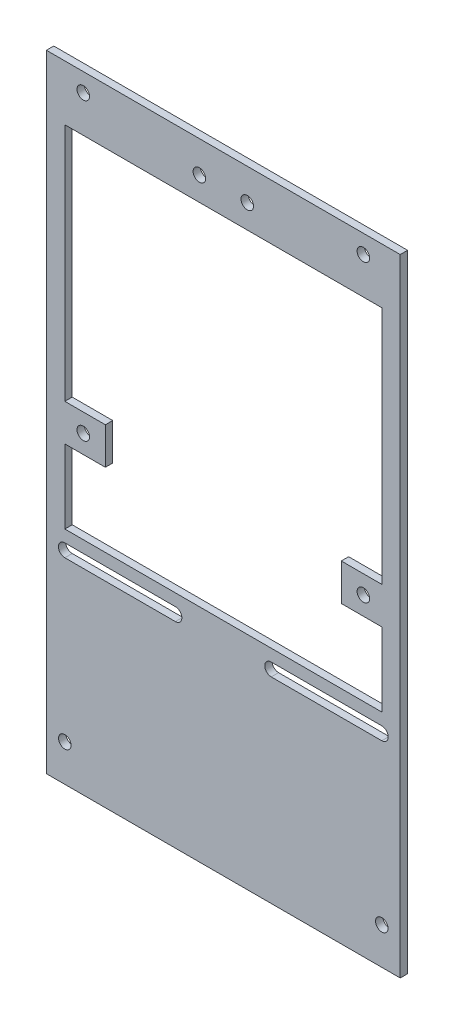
from build123d import *

# Parameters (mm, degrees)
SKETCH_1_W              = 94
SKETCH_1_H              = 170
EXTRUDE_1_DEPTH         = 2
HOLE_WIZARD_3_4_3_4_1_D = 3.4
HOLE_WIZARD_3_4_3_4_2_D = 3.4
HOLE_WIZARD_3_4_3_4_3_D = 3.4
CUT_EXTRUDE_1_DEPTH     = 10
SKETCH_9_W              = 2
SKETCH_9_H              = 170
EXTRUDE_2_DEPTH         = 1
SKETCH_10_W             = 2
SKETCH_10_H             = 170
EXTRUDE_3_DEPTH         = 1
CUT_EXTRUDE_2_REACH     = 99.637


with BuildPart() as part:
    # Sketch 1 → Extrude 1 (new body)
    with BuildSketch(Plane.XY):
        Rectangle(SKETCH_1_W, SKETCH_1_H)
    extrude(amount=EXTRUDE_1_DEPTH)

    # Hole Wizard 3.4 _3.4_ _1 (through all)
    with Locations(Plane(origin=(0, 0, 0), x_dir=(-1, 0, 0), z_dir=(0, 0, -1))):
        with Locations((-6.499996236, 76.443638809), (6.500003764, 76.443638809)):
            Hole(HOLE_WIZARD_3_4_3_4_1_D / 2)

    # Hole Wizard 3.4 _3.4_ _2 (through all)
    with Locations(Plane(origin=(0, 0, 0), x_dir=(-1, 0, 0), z_dir=(0, 0, -1))):
        with Locations((-43, -74.999999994), (43, -74.999999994)):
            Hole(HOLE_WIZARD_3_4_3_4_2_D / 2)

    # Hole Wizard 3.4 _3.4_ _3 (through all)
    with Locations(Plane(origin=(0, 0, 0), x_dir=(-1, 0, 0), z_dir=(0, 0, -1))):
        with Locations((-38, 80.000000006), (38, 80.000000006), (38, 6e-09), (-38, 6e-09)):
            Hole(HOLE_WIZARD_3_4_3_4_3_D / 2)

    # Sketch 8 → Cut-Extrude 1 (cut)
    with BuildSketch(Plane.XY.offset(2)):
        Polygon((-43, -5), (-32, -5), (-32, 5), (-43, 5), (-43, 70), (43, 70), (43, 5), (32, 5), (32, -5), (43, -5), (43, -25), (-43, -25), align=None)
    extrude(amount=-CUT_EXTRUDE_1_DEPTH, mode=Mode.SUBTRACT)

    # Sketch 9 → Extrude 2 (add)
    with BuildSketch(Plane(origin=(47, 0, 0), x_dir=(0, 0, -1), z_dir=(1, 0, 0))):
        with Locations((-1, 0)):
            Rectangle(SKETCH_9_W, SKETCH_9_H)
    extrude(amount=EXTRUDE_2_DEPTH)

    # Sketch 10 → Extrude 3 (add)
    with BuildSketch(Plane.ZY.offset(47)):
        with Locations((1, 0)):
            Rectangle(SKETCH_10_W, SKETCH_10_H)
    extrude(amount=EXTRUDE_3_DEPTH)

    # Sketch 11 → Cut-Extrude 2 (cut, up to next)
    with BuildSketch(Plane.XY.offset(2), mode=Mode.PRIVATE) as cut_extrude_2_sk1:
        with BuildLine():
            Line((-43, -28.25), (-13, -28.25))
            ThreePointArc((-13, -28.25), (-11.25, -30), (-13, -31.75))
            Line((-13, -31.75), (-43, -31.75))
            ThreePointArc((-43, -31.75), (-44.75, -30), (-43, -28.25))
        make_face()
    cut_extrude_2_tool1 = extrude(cut_extrude_2_sk1.sketch, amount=-CUT_EXTRUDE_2_REACH, mode=Mode.PRIVATE) & part.part
    # Sketch 11 → Cut-Extrude 2 (cut, up to next)
    with BuildSketch(Plane.XY.offset(2), mode=Mode.PRIVATE) as cut_extrude_2_sk2:
        with BuildLine():
            Line((13, -28.25), (43, -28.25))
            ThreePointArc((43, -28.25), (44.75, -30), (43, -31.75))
            Line((43, -31.75), (13, -31.75))
            ThreePointArc((13, -31.75), (11.25, -30), (13, -28.25))
        make_face()
    cut_extrude_2_tool2 = extrude(cut_extrude_2_sk2.sketch, amount=-CUT_EXTRUDE_2_REACH, mode=Mode.PRIVATE) & part.part
    add(cut_extrude_2_tool1.solids().sort_by_distance((-28, -30, 2))[0], mode=Mode.SUBTRACT)
    add(cut_extrude_2_tool2.solids().sort_by_distance((28, -30, 2))[0], mode=Mode.SUBTRACT)


solid = part.part
